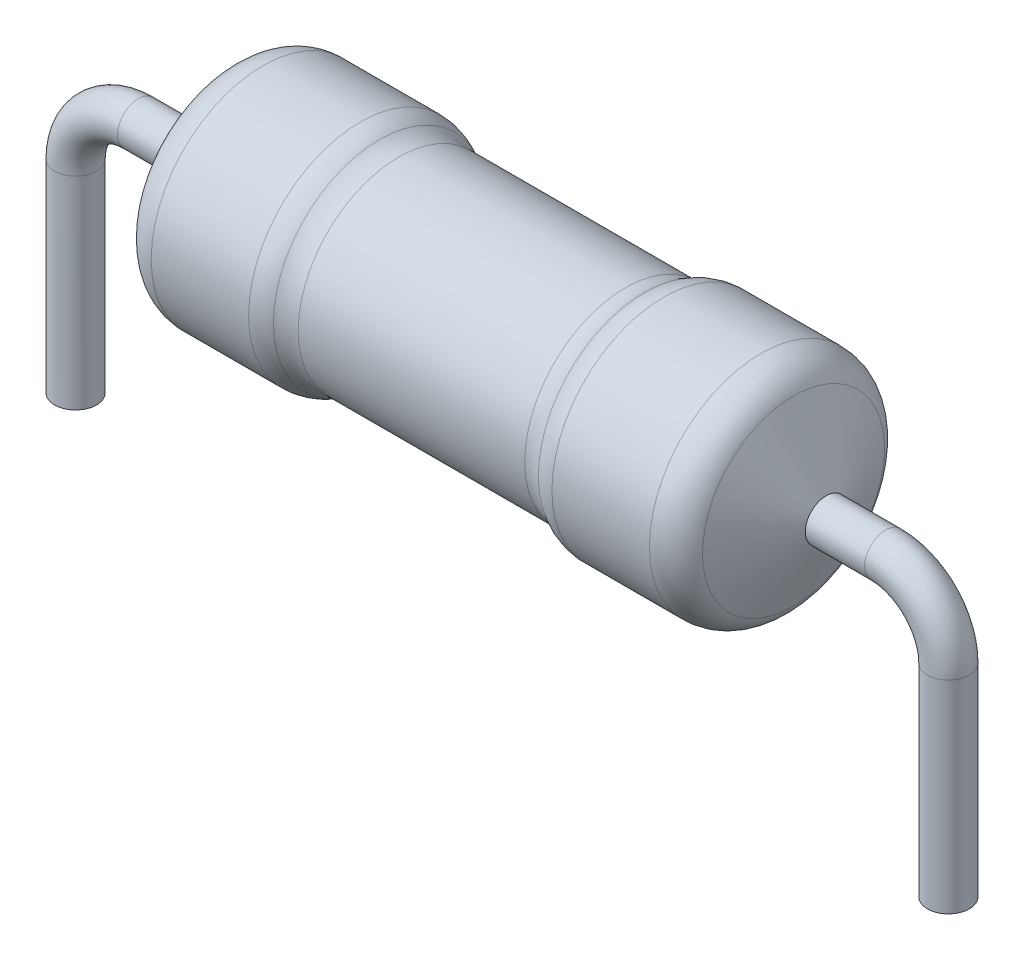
ISO-10303-21;
HEADER;
FILE_DESCRIPTION(('STEP AP214'),'2;1');
FILE_NAME('part.step','',(''),(''),'','','');
FILE_SCHEMA(('AUTOMOTIVE_DESIGN { 1 0 10303 214 1 1 1 1 }'));
ENDSEC;
DATA;
#1=APPLICATION_CONTEXT('core data for automotive mechanical design processes');
#2=APPLICATION_PROTOCOL_DEFINITION('international standard','automotive_design',2000,#1);
#3=PRODUCT_CONTEXT('',#1,'mechanical');
#4=PRODUCT('Part','Part','',(#3));
#5=PRODUCT_RELATED_PRODUCT_CATEGORY('part','',(#4));
#6=PRODUCT_DEFINITION_FORMATION('','',#4);
#7=PRODUCT_DEFINITION_CONTEXT('part definition',#1,'design');
#8=PRODUCT_DEFINITION('design','',#6,#7);
#9=PRODUCT_DEFINITION_SHAPE('','',#8);
#10=(LENGTH_UNIT() NAMED_UNIT(*) SI_UNIT(.MILLI.,.METRE.));
#11=(NAMED_UNIT(*) PLANE_ANGLE_UNIT() SI_UNIT($,.RADIAN.));
#12=(NAMED_UNIT(*) SI_UNIT($,.STERADIAN.) SOLID_ANGLE_UNIT());
#13=UNCERTAINTY_MEASURE_WITH_UNIT(LENGTH_MEASURE(1.E-05),#10,'distance_accuracy_value','');
#14=(GEOMETRIC_REPRESENTATION_CONTEXT(3) GLOBAL_UNCERTAINTY_ASSIGNED_CONTEXT((#13)) GLOBAL_UNIT_ASSIGNED_CONTEXT((#10,
#11,#12)) REPRESENTATION_CONTEXT('',''));
#15=CARTESIAN_POINT('',(0.,0.,0.));
#16=DIRECTION('',(0.,0.,1.));
#17=DIRECTION('',(1.,0.,0.));
#18=AXIS2_PLACEMENT_3D('',#15,#16,#17);
#19=CARTESIAN_POINT('',(4.03164965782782,1.6,0.));
#20=DIRECTION('',(-1.,0.,0.));
#21=DIRECTION('',(0.,0.,1.));
#22=AXIS2_PLACEMENT_3D('',#19,#20,#21);
#23=CONICAL_SURFACE('',#22,1.30438055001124,1.13446401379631);
#24=CARTESIAN_POINT('',(4.5,1.6,0.));
#25=DIRECTION('',(-1.,0.,0.));
#26=DIRECTION('',(0.,0.,1.));
#27=AXIS2_PLACEMENT_3D('',#24,#25,#26);
#28=CIRCLE('',#27,0.3);
#29=CARTESIAN_POINT('',(4.5,1.6,0.299999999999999));
#30=VERTEX_POINT('',#29);
#31=EDGE_CURVE('E68',#30,#30,#28,.F.);
#32=CARTESIAN_POINT('',(4.03164965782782,1.6,0.));
#33=DIRECTION('',(-1.,0.,0.));
#34=DIRECTION('',(0.,0.,1.));
#35=AXIS2_PLACEMENT_3D('',#32,#33,#34);
#36=CIRCLE('',#35,1.30438055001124);
#37=CARTESIAN_POINT('',(4.03164965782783,1.6,1.30438055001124));
#38=VERTEX_POINT('',#37);
#39=EDGE_CURVE('E10',#38,#38,#36,.T.);
#40=CARTESIAN_POINT('',(4.5,1.6,0.299999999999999));
#41=CARTESIAN_POINT('',(4.49512135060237,1.6,0.310462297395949));
#42=CARTESIAN_POINT('',(4.49024270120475,1.6,0.3209245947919));
#43=CARTESIAN_POINT('',(4.48048540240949,1.6,0.341849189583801));
#44=CARTESIAN_POINT('',(4.47560675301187,1.6,0.352311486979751));
#45=CARTESIAN_POINT('',(4.46584945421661,1.6,0.373236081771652));
#46=CARTESIAN_POINT('',(4.46097080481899,1.6,0.383698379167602));
#47=CARTESIAN_POINT('',(4.45121350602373,1.6,0.404622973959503));
#48=CARTESIAN_POINT('',(4.44633485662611,1.6,0.415085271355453));
#49=CARTESIAN_POINT('',(4.43657755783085,1.6,0.436009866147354));
#50=CARTESIAN_POINT('',(4.43169890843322,1.6,0.446472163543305));
#51=CARTESIAN_POINT('',(4.42194160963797,1.6,0.467396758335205));
#52=CARTESIAN_POINT('',(4.41706296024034,1.6,0.477859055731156));
#53=CARTESIAN_POINT('',(4.40730566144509,1.6,0.498783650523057));
#54=CARTESIAN_POINT('',(4.40242701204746,1.6,0.509245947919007));
#55=CARTESIAN_POINT('',(4.39266971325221,1.6,0.530170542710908));
#56=CARTESIAN_POINT('',(4.38779106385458,1.6,0.540632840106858));
#57=CARTESIAN_POINT('',(4.37803376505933,1.6,0.561557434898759));
#58=CARTESIAN_POINT('',(4.3731551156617,1.6,0.57201973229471));
#59=CARTESIAN_POINT('',(4.36339781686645,1.6,0.59294432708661));
#60=CARTESIAN_POINT('',(4.35851916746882,1.6,0.603406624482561));
#61=CARTESIAN_POINT('',(4.34876186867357,1.6,0.624331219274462));
#62=CARTESIAN_POINT('',(4.34388321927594,1.6,0.634793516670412));
#63=CARTESIAN_POINT('',(4.33412592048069,1.6,0.655718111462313));
#64=CARTESIAN_POINT('',(4.32924727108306,1.6,0.666180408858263));
#65=CARTESIAN_POINT('',(4.31948997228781,1.6,0.687105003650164));
#66=CARTESIAN_POINT('',(4.31461132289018,1.6,0.697567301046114));
#67=CARTESIAN_POINT('',(4.30485402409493,1.6,0.718491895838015));
#68=CARTESIAN_POINT('',(4.2999753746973,1.6,0.728954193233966));
#69=CARTESIAN_POINT('',(4.29021807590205,1.6,0.749878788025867));
#70=CARTESIAN_POINT('',(4.28533942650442,1.6,0.760341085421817));
#71=CARTESIAN_POINT('',(4.27558212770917,1.6,0.781265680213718));
#72=CARTESIAN_POINT('',(4.27070347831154,1.6,0.791727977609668));
#73=CARTESIAN_POINT('',(4.26094617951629,1.6,0.812652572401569));
#74=CARTESIAN_POINT('',(4.25606753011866,1.6,0.823114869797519));
#75=CARTESIAN_POINT('',(4.24631023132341,1.6,0.84403946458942));
#76=CARTESIAN_POINT('',(4.24143158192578,1.6,0.854501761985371));
#77=CARTESIAN_POINT('',(4.23167428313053,1.6,0.875426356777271));
#78=CARTESIAN_POINT('',(4.2267956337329,1.6,0.885888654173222));
#79=CARTESIAN_POINT('',(4.21703833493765,1.6,0.906813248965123));
#80=CARTESIAN_POINT('',(4.21215968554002,1.6,0.917275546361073));
#81=CARTESIAN_POINT('',(4.20240238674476,1.6,0.938200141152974));
#82=CARTESIAN_POINT('',(4.19752373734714,1.6,0.948662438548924));
#83=CARTESIAN_POINT('',(4.18776643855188,1.6,0.969587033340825));
#84=CARTESIAN_POINT('',(4.18288778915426,1.6,0.980049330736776));
#85=CARTESIAN_POINT('',(4.173130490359,1.6,1.00097392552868));
#86=CARTESIAN_POINT('',(4.16825184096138,1.6,1.01143622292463));
#87=CARTESIAN_POINT('',(4.15849454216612,1.6,1.03236081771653));
#88=CARTESIAN_POINT('',(4.1536158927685,1.6,1.04282311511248));
#89=CARTESIAN_POINT('',(4.14385859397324,1.6,1.06374770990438));
#90=CARTESIAN_POINT('',(4.13897994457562,1.6,1.07421000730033));
#91=CARTESIAN_POINT('',(4.12922264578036,1.6,1.09513460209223));
#92=CARTESIAN_POINT('',(4.12434399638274,1.6,1.10559689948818));
#93=CARTESIAN_POINT('',(4.11458669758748,1.6,1.12652149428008));
#94=CARTESIAN_POINT('',(4.10970804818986,1.6,1.13698379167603));
#95=CARTESIAN_POINT('',(4.0999507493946,1.6,1.15790838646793));
#96=CARTESIAN_POINT('',(4.09507209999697,1.6,1.16837068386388));
#97=CARTESIAN_POINT('',(4.08531480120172,1.6,1.18929527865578));
#98=CARTESIAN_POINT('',(4.08043615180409,1.6,1.19975757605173));
#99=CARTESIAN_POINT('',(4.07067885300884,1.6,1.22068217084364));
#100=CARTESIAN_POINT('',(4.06580020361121,1.6,1.23114446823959));
#101=CARTESIAN_POINT('',(4.05604290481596,1.6,1.25206906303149));
#102=CARTESIAN_POINT('',(4.05116425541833,1.6,1.26253136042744));
#103=CARTESIAN_POINT('',(4.04140695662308,1.6,1.28345595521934));
#104=CARTESIAN_POINT('',(4.03652830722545,1.6,1.29391825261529));
#105=CARTESIAN_POINT('',(4.03164965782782,1.6,1.30438055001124));
#106=B_SPLINE_CURVE_WITH_KNOTS('',3,(#40,#41,#42,#43,#44,#45,#46,#47,#48,#49,#50,#51,#52,#53,
#54,#55,#56,#57,#58,#59,#60,#61,#62,#63,#64,#65,#66,#67,#68,#69,#70,#71,#72,#73,#74,#75,#76,#77,
#78,#79,#80,#81,#82,#83,#84,#85,#86,#87,#88,#89,#90,#91,#92,#93,#94,#95,#96,#97,#98,#99,#100,
#101,#102,#103,#104,#105),.UNSPECIFIED.,.F.,.F.,(4,2,2,2,2,2,2,2,2,2,2,2,2,2,2,2,2,2,2,2,2,2,2,
2,2,2,2,2,2,2,2,2,4),(0.,0.0346316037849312,0.0692632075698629,0.103894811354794,
0.138526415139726,0.173158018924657,0.207789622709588,0.24242122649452,0.277052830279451,
0.311684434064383,0.346316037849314,0.380947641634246,0.415579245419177,0.450210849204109,
0.48484245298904,0.519474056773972,0.554105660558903,0.588737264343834,0.623368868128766,
0.658000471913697,0.692632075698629,0.72726367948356,0.761895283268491,0.796526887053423,
0.831158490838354,0.865790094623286,0.900421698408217,0.935053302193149,0.96968490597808,
1.00431650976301,1.03894811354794,1.07357971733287,1.10821132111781),.UNSPECIFIED.);
#107=EDGE_CURVE('BSEAM28',#30,#38,#106,.T.);
#108=ORIENTED_EDGE('',*,*,#31,.F.);
#109=ORIENTED_EDGE('',*,*,#39,.F.);
#110=ORIENTED_EDGE('',*,*,#107,.T.);
#111=ORIENTED_EDGE('',*,*,#107,.F.);
#112=EDGE_LOOP('',(#108,#110,#109,#111));
#113=FACE_BOUND('',#112,.T.);
#114=ADVANCED_FACE('F28',(#113),#23,.T.);
#115=CARTESIAN_POINT('',(3.56762007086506,1.6,0.));
#116=DIRECTION('',(-1.,0.,0.));
#117=DIRECTION('',(0.,0.,1.));
#118=AXIS2_PLACEMENT_3D('',#115,#116,#117);
#119=TOROIDAL_SURFACE('',#118,1.088,0.512);
#120=ORIENTED_EDGE('',*,*,#39,.T.);
#121=EDGE_LOOP('',(#120));
#122=FACE_BOUND('',#121,.T.);
#123=CARTESIAN_POINT('',(3.56762007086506,1.6,0.));
#124=DIRECTION('',(-1.,0.,0.));
#125=DIRECTION('',(0.,0.,1.));
#126=AXIS2_PLACEMENT_3D('',#123,#124,#125);
#127=CIRCLE('',#126,1.6);
#128=CARTESIAN_POINT('',(3.56762007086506,1.6,1.6));
#129=VERTEX_POINT('',#128);
#130=EDGE_CURVE('E34',#129,#129,#127,.T.);
#131=ORIENTED_EDGE('',*,*,#130,.F.);
#132=EDGE_LOOP('',(#131));
#133=FACE_BOUND('',#132,.T.);
#134=ADVANCED_FACE('F111',(#122,#133),#119,.T.);
#135=CARTESIAN_POINT('',(-4.5,1.6,0.));
#136=DIRECTION('',(-1.,0.,0.));
#137=DIRECTION('',(0.,0.,1.));
#138=AXIS2_PLACEMENT_3D('',#135,#136,#137);
#139=CYLINDRICAL_SURFACE('',#138,1.6);
#140=ORIENTED_EDGE('',*,*,#130,.T.);
#141=EDGE_LOOP('',(#140));
#142=FACE_BOUND('',#141,.T.);
#143=CARTESIAN_POINT('',(2.17180640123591,1.6,0.));
#144=DIRECTION('',(-1.,0.,0.));
#145=DIRECTION('',(0.,0.,1.));
#146=AXIS2_PLACEMENT_3D('',#143,#144,#145);
#147=CIRCLE('',#146,1.6);
#148=CARTESIAN_POINT('',(2.17180640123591,1.6,1.6));
#149=VERTEX_POINT('',#148);
#150=EDGE_CURVE('E38',#149,#149,#147,.T.);
#151=ORIENTED_EDGE('',*,*,#150,.F.);
#152=EDGE_LOOP('',(#151));
#153=FACE_BOUND('',#152,.T.);
#154=ADVANCED_FACE('F116',(#142,#153),#139,.T.);
#155=CARTESIAN_POINT('',(2.17180640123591,1.6,0.));
#156=DIRECTION('',(-1.,0.,0.));
#157=DIRECTION('',(0.,0.,1.));
#158=AXIS2_PLACEMENT_3D('',#155,#156,#157);
#159=TOROIDAL_SURFACE('',#158,1.088,0.512);
#160=ORIENTED_EDGE('',*,*,#150,.T.);
#161=EDGE_LOOP('',(#160));
#162=FACE_BOUND('',#161,.T.);
#163=CARTESIAN_POINT('',(1.89699737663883,1.6,0.));
#164=DIRECTION('',(-1.,0.,0.));
#165=DIRECTION('',(0.,0.,1.));
#166=AXIS2_PLACEMENT_3D('',#163,#164,#165);
#167=CIRCLE('',#166,1.52);
#168=CARTESIAN_POINT('',(1.89699737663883,1.6,1.52));
#169=VERTEX_POINT('',#168);
#170=EDGE_CURVE('E42',#169,#169,#167,.T.);
#171=ORIENTED_EDGE('',*,*,#170,.F.);
#172=EDGE_LOOP('',(#171));
#173=FACE_BOUND('',#172,.T.);
#174=ADVANCED_FACE('F240',(#162,#173),#159,.T.);
#175=CARTESIAN_POINT('',(1.62218835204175,1.6,0.));
#176=DIRECTION('',(-1.,0.,0.));
#177=DIRECTION('',(0.,0.,1.));
#178=AXIS2_PLACEMENT_3D('',#175,#176,#177);
#179=TOROIDAL_SURFACE('',#178,1.952,0.512);
#180=ORIENTED_EDGE('',*,*,#170,.T.);
#181=EDGE_LOOP('',(#180));
#182=FACE_BOUND('',#181,.T.);
#183=CARTESIAN_POINT('',(1.62218835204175,1.6,0.));
#184=DIRECTION('',(-1.,0.,0.));
#185=DIRECTION('',(0.,0.,1.));
#186=AXIS2_PLACEMENT_3D('',#183,#184,#185);
#187=CIRCLE('',#186,1.44);
#188=CARTESIAN_POINT('',(1.62218835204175,1.6,1.44));
#189=VERTEX_POINT('',#188);
#190=EDGE_CURVE('E47',#189,#189,#187,.T.);
#191=ORIENTED_EDGE('',*,*,#190,.F.);
#192=EDGE_LOOP('',(#191));
#193=FACE_BOUND('',#192,.T.);
#194=ADVANCED_FACE('F230',(#182,#193),#179,.F.);
#195=CARTESIAN_POINT('',(-4.5,1.6,0.));
#196=DIRECTION('',(-1.,0.,0.));
#197=DIRECTION('',(0.,0.,1.));
#198=AXIS2_PLACEMENT_3D('',#195,#196,#197);
#199=CYLINDRICAL_SURFACE('',#198,1.44);
#200=ORIENTED_EDGE('',*,*,#190,.T.);
#201=EDGE_LOOP('',(#200));
#202=FACE_BOUND('',#201,.T.);
#203=CARTESIAN_POINT('',(-1.62218835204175,1.6,0.));
#204=DIRECTION('',(-1.,0.,0.));
#205=DIRECTION('',(0.,0.,1.));
#206=AXIS2_PLACEMENT_3D('',#203,#204,#205);
#207=CIRCLE('',#206,1.44);
#208=CARTESIAN_POINT('',(-1.62218835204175,1.6,1.44));
#209=VERTEX_POINT('',#208);
#210=EDGE_CURVE('E50',#209,#209,#207,.T.);
#211=ORIENTED_EDGE('',*,*,#210,.F.);
#212=EDGE_LOOP('',(#211));
#213=FACE_BOUND('',#212,.T.);
#214=ADVANCED_FACE('F220',(#202,#213),#199,.T.);
#215=CARTESIAN_POINT('',(-1.62218835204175,1.6,0.));
#216=DIRECTION('',(-1.,0.,0.));
#217=DIRECTION('',(0.,0.,1.));
#218=AXIS2_PLACEMENT_3D('',#215,#216,#217);
#219=TOROIDAL_SURFACE('',#218,1.952,0.512);
#220=ORIENTED_EDGE('',*,*,#210,.T.);
#221=EDGE_LOOP('',(#220));
#222=FACE_BOUND('',#221,.T.);
#223=CARTESIAN_POINT('',(-1.89699737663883,1.6,0.));
#224=DIRECTION('',(-1.,0.,0.));
#225=DIRECTION('',(0.,0.,1.));
#226=AXIS2_PLACEMENT_3D('',#223,#224,#225);
#227=CIRCLE('',#226,1.52);
#228=CARTESIAN_POINT('',(-1.89699737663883,1.6,1.52));
#229=VERTEX_POINT('',#228);
#230=EDGE_CURVE('E53',#229,#229,#227,.T.);
#231=ORIENTED_EDGE('',*,*,#230,.F.);
#232=EDGE_LOOP('',(#231));
#233=FACE_BOUND('',#232,.T.);
#234=ADVANCED_FACE('F210',(#222,#233),#219,.F.);
#235=CARTESIAN_POINT('',(-2.17180640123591,1.6,0.));
#236=DIRECTION('',(-1.,0.,0.));
#237=DIRECTION('',(0.,0.,1.));
#238=AXIS2_PLACEMENT_3D('',#235,#236,#237);
#239=TOROIDAL_SURFACE('',#238,1.088,0.512);
#240=ORIENTED_EDGE('',*,*,#230,.T.);
#241=EDGE_LOOP('',(#240));
#242=FACE_BOUND('',#241,.T.);
#243=CARTESIAN_POINT('',(-2.17180640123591,1.6,0.));
#244=DIRECTION('',(-1.,0.,0.));
#245=DIRECTION('',(0.,0.,1.));
#246=AXIS2_PLACEMENT_3D('',#243,#244,#245);
#247=CIRCLE('',#246,1.6);
#248=CARTESIAN_POINT('',(-2.17180640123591,1.6,1.6));
#249=VERTEX_POINT('',#248);
#250=EDGE_CURVE('E56',#249,#249,#247,.T.);
#251=ORIENTED_EDGE('',*,*,#250,.F.);
#252=EDGE_LOOP('',(#251));
#253=FACE_BOUND('',#252,.T.);
#254=ADVANCED_FACE('F200',(#242,#253),#239,.T.);
#255=CARTESIAN_POINT('',(-4.5,1.6,0.));
#256=DIRECTION('',(-1.,0.,0.));
#257=DIRECTION('',(0.,0.,1.));
#258=AXIS2_PLACEMENT_3D('',#255,#256,#257);
#259=CYLINDRICAL_SURFACE('',#258,1.6);
#260=ORIENTED_EDGE('',*,*,#250,.T.);
#261=EDGE_LOOP('',(#260));
#262=FACE_BOUND('',#261,.T.);
#263=CARTESIAN_POINT('',(-3.56762007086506,1.6,0.));
#264=DIRECTION('',(-1.,0.,0.));
#265=DIRECTION('',(0.,0.,1.));
#266=AXIS2_PLACEMENT_3D('',#263,#264,#265);
#267=CIRCLE('',#266,1.6);
#268=CARTESIAN_POINT('',(-3.56762007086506,1.6,1.6));
#269=VERTEX_POINT('',#268);
#270=EDGE_CURVE('E59',#269,#269,#267,.T.);
#271=ORIENTED_EDGE('',*,*,#270,.F.);
#272=EDGE_LOOP('',(#271));
#273=FACE_BOUND('',#272,.T.);
#274=ADVANCED_FACE('F190',(#262,#273),#259,.T.);
#275=CARTESIAN_POINT('',(-3.56762007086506,1.6,0.));
#276=DIRECTION('',(-1.,0.,0.));
#277=DIRECTION('',(0.,0.,1.));
#278=AXIS2_PLACEMENT_3D('',#275,#276,#277);
#279=TOROIDAL_SURFACE('',#278,1.088,0.512);
#280=ORIENTED_EDGE('',*,*,#270,.T.);
#281=EDGE_LOOP('',(#280));
#282=FACE_BOUND('',#281,.T.);
#283=CARTESIAN_POINT('',(-4.03164965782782,1.6,0.));
#284=DIRECTION('',(-1.,0.,0.));
#285=DIRECTION('',(0.,0.,1.));
#286=AXIS2_PLACEMENT_3D('',#283,#284,#285);
#287=CIRCLE('',#286,1.30438055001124);
#288=CARTESIAN_POINT('',(-4.03164965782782,1.6,-1.30438055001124));
#289=VERTEX_POINT('',#288);
#290=EDGE_CURVE('E62',#289,#289,#287,.T.);
#291=ORIENTED_EDGE('',*,*,#290,.F.);
#292=EDGE_LOOP('',(#291));
#293=FACE_BOUND('',#292,.T.);
#294=ADVANCED_FACE('F106',(#282,#293),#279,.T.);
#295=CARTESIAN_POINT('',(-4.5,1.6,0.));
#296=DIRECTION('',(1.,0.,0.));
#297=DIRECTION('',(0.,0.,-1.));
#298=AXIS2_PLACEMENT_3D('',#295,#296,#297);
#299=CONICAL_SURFACE('',#298,0.3,1.13446401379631);
#300=CARTESIAN_POINT('',(-4.5,1.6,0.));
#301=DIRECTION('',(-1.,0.,0.));
#302=DIRECTION('',(0.,0.,1.));
#303=AXIS2_PLACEMENT_3D('',#300,#301,#302);
#304=CIRCLE('',#303,0.3);
#305=CARTESIAN_POINT('',(-4.5,1.6,-0.300000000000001));
#306=VERTEX_POINT('',#305);
#307=EDGE_CURVE('E65',#306,#306,#304,.T.);
#308=CARTESIAN_POINT('',(-4.03164965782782,1.6,-1.30438055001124));
#309=CARTESIAN_POINT('',(-4.03652830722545,1.6,-1.29391825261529));
#310=CARTESIAN_POINT('',(-4.04140695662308,1.6,-1.28345595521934));
#311=CARTESIAN_POINT('',(-4.05116425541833,1.6,-1.26253136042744));
#312=CARTESIAN_POINT('',(-4.05604290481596,1.6,-1.25206906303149));
#313=CARTESIAN_POINT('',(-4.06580020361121,1.6,-1.23114446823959));
#314=CARTESIAN_POINT('',(-4.07067885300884,1.6,-1.22068217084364));
#315=CARTESIAN_POINT('',(-4.08043615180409,1.6,-1.19975757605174));
#316=CARTESIAN_POINT('',(-4.08531480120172,1.6,-1.18929527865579));
#317=CARTESIAN_POINT('',(-4.09507209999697,1.6,-1.16837068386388));
#318=CARTESIAN_POINT('',(-4.0999507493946,1.6,-1.15790838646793));
#319=CARTESIAN_POINT('',(-4.10970804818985,1.6,-1.13698379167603));
#320=CARTESIAN_POINT('',(-4.11458669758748,1.6,-1.12652149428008));
#321=CARTESIAN_POINT('',(-4.12434399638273,1.6,-1.10559689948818));
#322=CARTESIAN_POINT('',(-4.12922264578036,1.6,-1.09513460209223));
#323=CARTESIAN_POINT('',(-4.13897994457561,1.6,-1.07421000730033));
#324=CARTESIAN_POINT('',(-4.14385859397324,1.6,-1.06374770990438));
#325=CARTESIAN_POINT('',(-4.15361589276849,1.6,-1.04282311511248));
#326=CARTESIAN_POINT('',(-4.15849454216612,1.6,-1.03236081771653));
#327=CARTESIAN_POINT('',(-4.16825184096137,1.6,-1.01143622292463));
#328=CARTESIAN_POINT('',(-4.173130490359,1.6,-1.00097392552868));
#329=CARTESIAN_POINT('',(-4.18288778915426,1.6,-0.980049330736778));
#330=CARTESIAN_POINT('',(-4.18776643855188,1.6,-0.969587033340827));
#331=CARTESIAN_POINT('',(-4.19752373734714,1.6,-0.948662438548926));
#332=CARTESIAN_POINT('',(-4.20240238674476,1.6,-0.938200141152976));
#333=CARTESIAN_POINT('',(-4.21215968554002,1.6,-0.917275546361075));
#334=CARTESIAN_POINT('',(-4.21703833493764,1.6,-0.906813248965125));
#335=CARTESIAN_POINT('',(-4.2267956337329,1.6,-0.885888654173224));
#336=CARTESIAN_POINT('',(-4.23167428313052,1.6,-0.875426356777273));
#337=CARTESIAN_POINT('',(-4.24143158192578,1.6,-0.854501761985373));
#338=CARTESIAN_POINT('',(-4.2463102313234,1.6,-0.844039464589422));
#339=CARTESIAN_POINT('',(-4.25606753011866,1.6,-0.823114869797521));
#340=CARTESIAN_POINT('',(-4.26094617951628,1.6,-0.812652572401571));
#341=CARTESIAN_POINT('',(-4.27070347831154,1.6,-0.79172797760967));
#342=CARTESIAN_POINT('',(-4.27558212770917,1.6,-0.78126568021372));
#343=CARTESIAN_POINT('',(-4.28533942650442,1.6,-0.760341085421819));
#344=CARTESIAN_POINT('',(-4.29021807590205,1.6,-0.749878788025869));
#345=CARTESIAN_POINT('',(-4.2999753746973,1.6,-0.728954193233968));
#346=CARTESIAN_POINT('',(-4.30485402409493,1.6,-0.718491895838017));
#347=CARTESIAN_POINT('',(-4.31461132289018,1.6,-0.697567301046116));
#348=CARTESIAN_POINT('',(-4.31948997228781,1.6,-0.687105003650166));
#349=CARTESIAN_POINT('',(-4.32924727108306,1.6,-0.666180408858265));
#350=CARTESIAN_POINT('',(-4.33412592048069,1.6,-0.655718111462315));
#351=CARTESIAN_POINT('',(-4.34388321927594,1.6,-0.634793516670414));
#352=CARTESIAN_POINT('',(-4.34876186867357,1.6,-0.624331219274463));
#353=CARTESIAN_POINT('',(-4.35851916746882,1.6,-0.603406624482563));
#354=CARTESIAN_POINT('',(-4.36339781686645,1.6,-0.592944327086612));
#355=CARTESIAN_POINT('',(-4.3731551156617,1.6,-0.572019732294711));
#356=CARTESIAN_POINT('',(-4.37803376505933,1.6,-0.561557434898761));
#357=CARTESIAN_POINT('',(-4.38779106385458,1.6,-0.54063284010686));
#358=CARTESIAN_POINT('',(-4.39266971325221,1.6,-0.53017054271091));
#359=CARTESIAN_POINT('',(-4.40242701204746,1.6,-0.509245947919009));
#360=CARTESIAN_POINT('',(-4.40730566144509,1.6,-0.498783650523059));
#361=CARTESIAN_POINT('',(-4.41706296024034,1.6,-0.477859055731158));
#362=CARTESIAN_POINT('',(-4.42194160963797,1.6,-0.467396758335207));
#363=CARTESIAN_POINT('',(-4.43169890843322,1.6,-0.446472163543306));
#364=CARTESIAN_POINT('',(-4.43657755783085,1.6,-0.436009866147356));
#365=CARTESIAN_POINT('',(-4.4463348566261,1.6,-0.415085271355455));
#366=CARTESIAN_POINT('',(-4.45121350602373,1.6,-0.404622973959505));
#367=CARTESIAN_POINT('',(-4.46097080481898,1.6,-0.383698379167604));
#368=CARTESIAN_POINT('',(-4.46584945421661,1.6,-0.373236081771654));
#369=CARTESIAN_POINT('',(-4.47560675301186,1.6,-0.352311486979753));
#370=CARTESIAN_POINT('',(-4.48048540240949,1.6,-0.341849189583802));
#371=CARTESIAN_POINT('',(-4.49024270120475,1.6,-0.320924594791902));
#372=CARTESIAN_POINT('',(-4.49512135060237,1.6,-0.310462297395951));
#373=CARTESIAN_POINT('',(-4.5,1.6,-0.300000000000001));
#374=B_SPLINE_CURVE_WITH_KNOTS('',3,(#308,#309,#310,#311,#312,#313,#314,#315,#316,#317,#318,
#319,#320,#321,#322,#323,#324,#325,#326,#327,#328,#329,#330,#331,#332,#333,#334,#335,#336,#337,
#338,#339,#340,#341,#342,#343,#344,#345,#346,#347,#348,#349,#350,#351,#352,#353,#354,#355,#356,
#357,#358,#359,#360,#361,#362,#363,#364,#365,#366,#367,#368,#369,#370,#371,#372,#373),
.UNSPECIFIED.,.F.,.F.,(4,2,2,2,2,2,2,2,2,2,2,2,2,2,2,2,2,2,2,2,2,2,2,2,2,2,2,2,2,2,2,2,4),(0.,
0.0346316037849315,0.0692632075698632,0.103894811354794,0.138526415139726,0.173158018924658,
0.207789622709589,0.24242122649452,0.277052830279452,0.311684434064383,0.346316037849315,
0.380947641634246,0.415579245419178,0.450210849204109,0.48484245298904,0.519474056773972,
0.554105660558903,0.588737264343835,0.623368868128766,0.658000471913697,0.692632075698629,
0.727263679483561,0.761895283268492,0.796526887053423,0.831158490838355,0.865790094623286,
0.900421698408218,0.935053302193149,0.96968490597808,1.00431650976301,1.03894811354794,
1.07357971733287,1.10821132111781),.UNSPECIFIED.);
#375=EDGE_CURVE('BSEAM101',#289,#306,#374,.T.);
#376=ORIENTED_EDGE('',*,*,#290,.T.);
#377=ORIENTED_EDGE('',*,*,#307,.F.);
#378=ORIENTED_EDGE('',*,*,#375,.T.);
#379=ORIENTED_EDGE('',*,*,#375,.F.);
#380=EDGE_LOOP('',(#376,#378,#377,#379));
#381=FACE_BOUND('',#380,.T.);
#382=ADVANCED_FACE('F101',(#381),#299,.T.);
#383=CARTESIAN_POINT('',(-6.25,-2.2,0.));
#384=DIRECTION('',(0.,1.,0.));
#385=DIRECTION('',(0.,0.,1.));
#386=AXIS2_PLACEMENT_3D('',#383,#384,#385);
#387=PLANE('',#386);
#388=CARTESIAN_POINT('',(-6.25,-2.2,0.));
#389=DIRECTION('',(0.,1.,0.));
#390=DIRECTION('',(0.,0.,1.));
#391=AXIS2_PLACEMENT_3D('',#388,#389,#390);
#392=CIRCLE('',#391,0.3);
#393=CARTESIAN_POINT('',(-6.25,-2.2,0.3));
#394=VERTEX_POINT('',#393);
#395=EDGE_CURVE('E84',#394,#394,#392,.T.);
#396=ORIENTED_EDGE('',*,*,#395,.F.);
#397=EDGE_LOOP('',(#396));
#398=FACE_BOUND('',#397,.T.);
#399=ADVANCED_FACE('F96',(#398),#387,.F.);
#400=CARTESIAN_POINT('',(-6.25,0.699999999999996,0.));
#401=DIRECTION('',(0.,-1.,0.));
#402=DIRECTION('',(0.,0.,-1.));
#403=AXIS2_PLACEMENT_3D('',#400,#401,#402);
#404=CYLINDRICAL_SURFACE('',#403,0.3);
#405=CARTESIAN_POINT('',(-6.25,0.699999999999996,0.));
#406=DIRECTION('',(0.,1.,0.));
#407=DIRECTION('',(0.,0.,1.));
#408=AXIS2_PLACEMENT_3D('',#405,#406,#407);
#409=CIRCLE('',#408,0.3);
#410=CARTESIAN_POINT('',(-6.55,0.699999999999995,0.));
#411=VERTEX_POINT('',#410);
#412=EDGE_CURVE('E83',#411,#411,#409,.T.);
#413=ORIENTED_EDGE('',*,*,#412,.F.);
#414=EDGE_LOOP('',(#413));
#415=FACE_BOUND('',#414,.T.);
#416=ORIENTED_EDGE('',*,*,#395,.T.);
#417=EDGE_LOOP('',(#416));
#418=FACE_BOUND('',#417,.T.);
#419=ADVANCED_FACE('F93',(#415,#418),#404,.T.);
#420=CARTESIAN_POINT('',(-5.35,0.7,0.));
#421=DIRECTION('',(0.,0.,-1.));
#422=DIRECTION('',(-1.,0.,0.));
#423=AXIS2_PLACEMENT_3D('',#420,#421,#422);
#424=TOROIDAL_SURFACE('',#423,0.9,0.3);
#425=CARTESIAN_POINT('',(-5.35,1.6,0.));
#426=DIRECTION('',(1.,0.,0.));
#427=DIRECTION('',(0.,0.,1.));
#428=AXIS2_PLACEMENT_3D('',#425,#426,#427);
#429=CIRCLE('',#428,0.3);
#430=CARTESIAN_POINT('',(-5.35,1.9,0.));
#431=VERTEX_POINT('',#430);
#432=EDGE_CURVE('E80',#431,#431,#429,.T.);
#433=CARTESIAN_POINT('',(-5.35,0.7,0.));
#434=DIRECTION('',(0.,0.,-1.));
#435=DIRECTION('',(-1.,0.,0.));
#436=AXIS2_PLACEMENT_3D('',#433,#434,#435);
#437=CIRCLE('',#436,1.2);
#438=EDGE_CURVE('',#411,#431,#437,.T.);
#439=ORIENTED_EDGE('',*,*,#412,.T.);
#440=ORIENTED_EDGE('',*,*,#432,.F.);
#441=ORIENTED_EDGE('',*,*,#438,.T.);
#442=ORIENTED_EDGE('',*,*,#438,.F.);
#443=EDGE_LOOP('',(#439,#441,#440,#442));
#444=FACE_BOUND('',#443,.T.);
#445=ADVANCED_FACE('F90',(#444),#424,.T.);
#446=CARTESIAN_POINT('',(-5.35,1.6,0.));
#447=DIRECTION('',(1.,0.,0.));
#448=DIRECTION('',(0.,0.,-1.));
#449=AXIS2_PLACEMENT_3D('',#446,#447,#448);
#450=CYLINDRICAL_SURFACE('',#449,0.3);
#451=ORIENTED_EDGE('',*,*,#307,.T.);
#452=EDGE_LOOP('',(#451));
#453=FACE_BOUND('',#452,.T.);
#454=ORIENTED_EDGE('',*,*,#432,.T.);
#455=EDGE_LOOP('',(#454));
#456=FACE_BOUND('',#455,.T.);
#457=ADVANCED_FACE('F124',(#453,#456),#450,.T.);
#458=ORIENTED_EDGE('',*,*,#31,.T.);
#459=EDGE_LOOP('',(#458));
#460=FACE_BOUND('',#459,.T.);
#461=CARTESIAN_POINT('',(5.35,1.6,0.));
#462=DIRECTION('',(1.,0.,0.));
#463=DIRECTION('',(0.,0.,1.));
#464=AXIS2_PLACEMENT_3D('',#461,#462,#463);
#465=CIRCLE('',#464,0.3);
#466=CARTESIAN_POINT('',(5.35,1.9,0.));
#467=VERTEX_POINT('',#466);
#468=EDGE_CURVE('E77',#467,#467,#465,.T.);
#469=ORIENTED_EDGE('',*,*,#468,.F.);
#470=EDGE_LOOP('',(#469));
#471=FACE_BOUND('',#470,.T.);
#472=ADVANCED_FACE('F120',(#460,#471),#450,.T.);
#473=CARTESIAN_POINT('',(6.25,0.700000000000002,0.));
#474=DIRECTION('',(0.,-1.,0.));
#475=DIRECTION('',(0.,0.,-1.));
#476=AXIS2_PLACEMENT_3D('',#473,#474,#475);
#477=CYLINDRICAL_SURFACE('',#476,0.3);
#478=CARTESIAN_POINT('',(6.25,0.700000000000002,0.));
#479=DIRECTION('',(0.,-1.,0.));
#480=DIRECTION('',(0.,0.,1.));
#481=AXIS2_PLACEMENT_3D('',#478,#479,#480);
#482=CIRCLE('',#481,0.3);
#483=CARTESIAN_POINT('',(6.55,0.700000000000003,0.));
#484=VERTEX_POINT('',#483);
#485=EDGE_CURVE('E74',#484,#484,#482,.T.);
#486=ORIENTED_EDGE('',*,*,#485,.T.);
#487=EDGE_LOOP('',(#486));
#488=FACE_BOUND('',#487,.T.);
#489=CARTESIAN_POINT('',(6.25,-2.19999999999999,0.));
#490=DIRECTION('',(0.,-1.,0.));
#491=DIRECTION('',(0.,0.,1.));
#492=AXIS2_PLACEMENT_3D('',#489,#490,#491);
#493=CIRCLE('',#492,0.3);
#494=CARTESIAN_POINT('',(6.25,-2.19999999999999,0.3));
#495=VERTEX_POINT('',#494);
#496=EDGE_CURVE('E71',#495,#495,#493,.T.);
#497=ORIENTED_EDGE('',*,*,#496,.F.);
#498=EDGE_LOOP('',(#497));
#499=FACE_BOUND('',#498,.T.);
#500=ADVANCED_FACE('F123',(#488,#499),#477,.T.);
#501=CARTESIAN_POINT('',(5.35,0.7,0.));
#502=DIRECTION('',(0.,0.,-1.));
#503=DIRECTION('',(-1.,0.,0.));
#504=AXIS2_PLACEMENT_3D('',#501,#502,#503);
#505=TOROIDAL_SURFACE('',#504,0.899999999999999,0.3);
#506=CARTESIAN_POINT('',(5.35,0.7,0.));
#507=DIRECTION('',(0.,0.,-1.));
#508=DIRECTION('',(-1.,0.,0.));
#509=AXIS2_PLACEMENT_3D('',#506,#507,#508);
#510=CIRCLE('',#509,1.2);
#511=EDGE_CURVE('',#467,#484,#510,.T.);
#512=ORIENTED_EDGE('',*,*,#468,.T.);
#513=ORIENTED_EDGE('',*,*,#485,.F.);
#514=ORIENTED_EDGE('',*,*,#511,.T.);
#515=ORIENTED_EDGE('',*,*,#511,.F.);
#516=EDGE_LOOP('',(#512,#514,#513,#515));
#517=FACE_BOUND('',#516,.T.);
#518=ADVANCED_FACE('F128',(#517),#505,.T.);
#519=CARTESIAN_POINT('',(6.25,-2.19999999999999,0.));
#520=DIRECTION('',(0.,-1.,0.));
#521=DIRECTION('',(0.,0.,1.));
#522=AXIS2_PLACEMENT_3D('',#519,#520,#521);
#523=PLANE('',#522);
#524=ORIENTED_EDGE('',*,*,#496,.T.);
#525=EDGE_LOOP('',(#524));
#526=FACE_BOUND('',#525,.T.);
#527=ADVANCED_FACE('F131',(#526),#523,.T.);
#528=CLOSED_SHELL('',(#114,#134,#154,#174,#194,#214,#234,#254,#274,#294,#382,#399,#419,#445,
#457,#472,#500,#518,#527));
#529=MANIFOLD_SOLID_BREP('B2',#528);
#530=ADVANCED_BREP_SHAPE_REPRESENTATION('',(#18,#529),#14);
#531=SHAPE_DEFINITION_REPRESENTATION(#9,#530);
ENDSEC;
END-ISO-10303-21;
